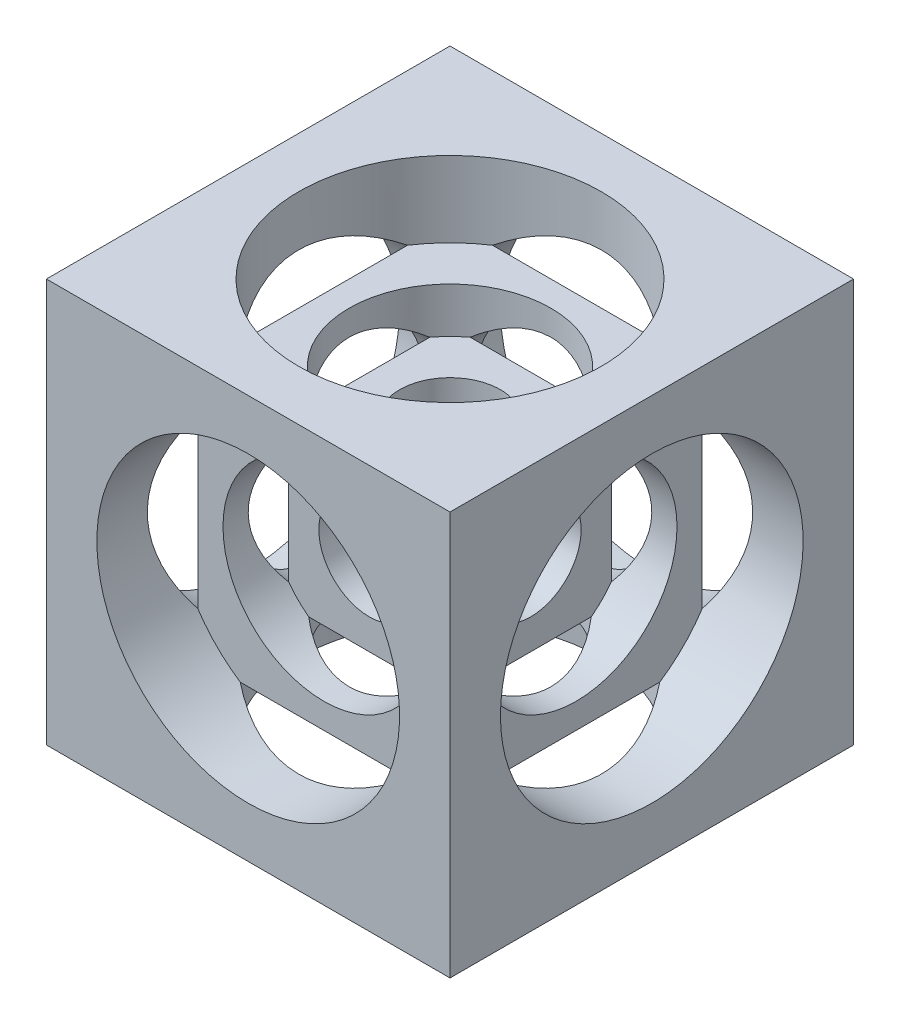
from build123d import *

# Parameters (mm, degrees)
SKETCH1_W           = 25.4
SKETCH1_H           = 25.4
BOSS_EXTRUDE2_DEPTH = 25.4
SKETCH5_R           = 3.175
CUT_EXTRUDE2_DEPTH  = 44.994090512
SKETCH6_R           = 3.175
CUT_EXTRUDE3_DEPTH  = 44.994090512
SKETCH7_R           = 3.175
CUT_EXTRUDE4_DEPTH  = 44.994090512
SKETCH8_R           = 6.35
CUT_EXTRUDE5_DEPTH  = 7.62
SKETCH9_R           = 9.525
CUT_EXTRUDE6_DEPTH  = 4.7625
CIRPATTERN1_COUNT   = 4
CIRPATTERN2_COUNT   = 2
CIRPATTERN2_ANGLE   = 90
CIRPATTERN3_COUNT   = 2
CIRPATTERN3_ANGLE   = 90


with BuildPart() as part:
    # Sketch1 → Boss-Extrude2 (new body)
    with BuildSketch(Plane(origin=(0, 0, 0), x_dir=(1, 0, 0), z_dir=(0, 1, 0))):
        with Locations((12.7, 12.7)):
            Rectangle(SKETCH1_W, SKETCH1_H)
    extrude(amount=BOSS_EXTRUDE2_DEPTH)

    # Sketch5 → Cut-Extrude2 (cut, through all)
    with BuildSketch(Plane(origin=(0, 25.4, 0), x_dir=(1, 0, 0), z_dir=(0, 1, 0))):
        with Locations(Location((12.7, 12.7, 0), (0, 0, 270))):
            Circle(SKETCH5_R)
    cut_extrude2 = extrude(amount=-CUT_EXTRUDE2_DEPTH, mode=Mode.SUBTRACT)

    # Sketch6 → Cut-Extrude3 (cut, through all)
    with BuildSketch(Plane.XY):
        with Locations((12.7, 12.7)):
            Circle(SKETCH6_R)
    extrude(amount=-CUT_EXTRUDE3_DEPTH, mode=Mode.SUBTRACT)

    # Sketch7 → Cut-Extrude4 (cut, through all)
    with BuildSketch(Plane(origin=(25.4, 0, 0), x_dir=(0, 0, -1), z_dir=(1, 0, 0))):
        with Locations((12.7, 12.7)):
            Circle(SKETCH7_R)
    extrude(amount=-CUT_EXTRUDE4_DEPTH, mode=Mode.SUBTRACT)

    # Sketch8 → Cut-Extrude5 (cut)
    with BuildSketch(Plane(origin=(0, 25.4, 0), x_dir=(1, 0, 0), z_dir=(0, 1, 0))):
        with Locations(Location((12.7, 12.7, 0), (0, 0, 270))):
            Circle(SKETCH8_R)
    cut_extrude5 = extrude(amount=-CUT_EXTRUDE5_DEPTH, mode=Mode.SUBTRACT)

    # Sketch9 → Cut-Extrude6 (cut)
    with BuildSketch(Plane(origin=(0, 25.4, 0), x_dir=(1, 0, 0), z_dir=(0, 1, 0))):
        with Locations(Location((12.7, 12.7, 0), (0, 0, 270))):
            Circle(SKETCH9_R)
    cut_extrude6 = extrude(amount=-CUT_EXTRUDE6_DEPTH, mode=Mode.SUBTRACT)

    # CirPattern1: Cut-Extrude2, Cut-Extrude5, Cut-Extrude6 ×4 about axis
    cirpattern1_axis = Axis((12.7, 12.7, 0), (0, 0, 1))
    add([cut_extrude2.rotate(cirpattern1_axis, i * 360 / CIRPATTERN1_COUNT) for i in range(1, CIRPATTERN1_COUNT)], mode=Mode.SUBTRACT)
    add([cut_extrude5.rotate(cirpattern1_axis, i * 360 / CIRPATTERN1_COUNT) for i in range(1, CIRPATTERN1_COUNT)], mode=Mode.SUBTRACT)
    add([cut_extrude6.rotate(cirpattern1_axis, i * 360 / CIRPATTERN1_COUNT) for i in range(1, CIRPATTERN1_COUNT)], mode=Mode.SUBTRACT)

    # CirPattern2: Cut-Extrude2, Cut-Extrude5, Cut-Extrude6 ×2 about axis
    cirpattern2_axis = Axis((0, 12.7, -12.7), (1, 0, 0))
    add([cut_extrude2.rotate(cirpattern2_axis, i * CIRPATTERN2_ANGLE / (CIRPATTERN2_COUNT - 1)) for i in range(1, CIRPATTERN2_COUNT)], mode=Mode.SUBTRACT)
    add([cut_extrude5.rotate(cirpattern2_axis, i * CIRPATTERN2_ANGLE / (CIRPATTERN2_COUNT - 1)) for i in range(1, CIRPATTERN2_COUNT)], mode=Mode.SUBTRACT)
    add([cut_extrude6.rotate(cirpattern2_axis, i * CIRPATTERN2_ANGLE / (CIRPATTERN2_COUNT - 1)) for i in range(1, CIRPATTERN2_COUNT)], mode=Mode.SUBTRACT)

    # CirPattern3: Cut-Extrude2, Cut-Extrude5, Cut-Extrude6 ×2 about axis
    cirpattern3_axis = Axis((0, 12.7, -12.7), (-1, 0, 0))
    add([cut_extrude2.rotate(cirpattern3_axis, i * CIRPATTERN3_ANGLE / (CIRPATTERN3_COUNT - 1)) for i in range(1, CIRPATTERN3_COUNT)], mode=Mode.SUBTRACT)
    add([cut_extrude5.rotate(cirpattern3_axis, i * CIRPATTERN3_ANGLE / (CIRPATTERN3_COUNT - 1)) for i in range(1, CIRPATTERN3_COUNT)], mode=Mode.SUBTRACT)
    add([cut_extrude6.rotate(cirpattern3_axis, i * CIRPATTERN3_ANGLE / (CIRPATTERN3_COUNT - 1)) for i in range(1, CIRPATTERN3_COUNT)], mode=Mode.SUBTRACT)


solid = part.part
